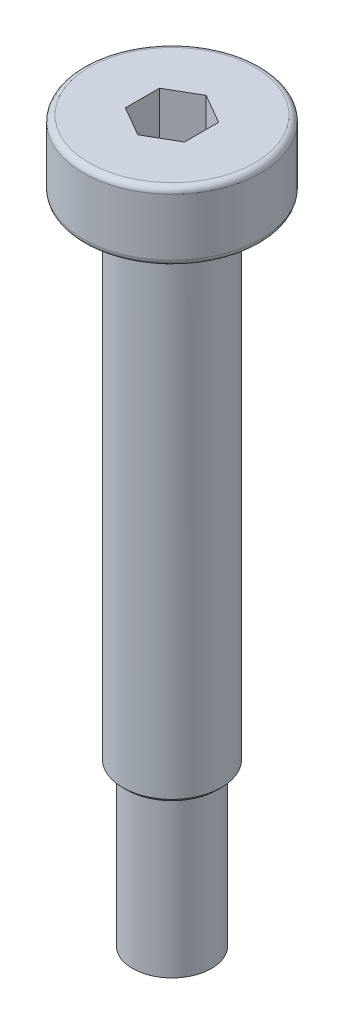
from build123d import *

# Parameters (mm, degrees)
FILLET_1_R          = 0.3
CUT_EXTRUDE_1_DEPTH = 2.4
CHAMFER_1_SIZE      = 0.2


with BuildPart() as part:
    # Sketch 1 → Revolve 1 (revolve)
    with BuildSketch(Plane.XY):
        Polygon((0, 3.5), (-4.5, 3.5), (-4.5, 0), (-2.5, 0), (-2.5, -25), (-2, -25), (-2, -33), (0, -33), align=None)
    revolve(axis=Axis((0, 3.5, 0), (0, -1, 0)))

    # Fillet 1
    fillet_1_edges = [part.edges().sort_by_distance(p)[0] for p in [
        (4.5, 3.5, 0),
        (4.5, 0, 0),
    ]]
    fillet(fillet_1_edges, radius=FILLET_1_R)

    # Sketch 2 → Cut-Extrude 1 (cut)
    with BuildSketch(Plane(origin=(0, 3.5, 0), x_dir=(1, 0, 0), z_dir=(0, 1, 0))):
        Polygon((0, 1.732050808), (-1.5, 0.866025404), (-1.5, -0.866025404), (0, -1.732050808), (1.5, -0.866025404), (1.5, 0.866025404), align=None)
    extrude(amount=-CUT_EXTRUDE_1_DEPTH, mode=Mode.SUBTRACT)

    # Chamfer 1
    chamfer_1_edges = [part.edges().sort_by_distance(p)[0] for p in [
        (2.5, -25, 0),
    ]]
    chamfer(chamfer_1_edges, length=CHAMFER_1_SIZE)


solid = part.part
